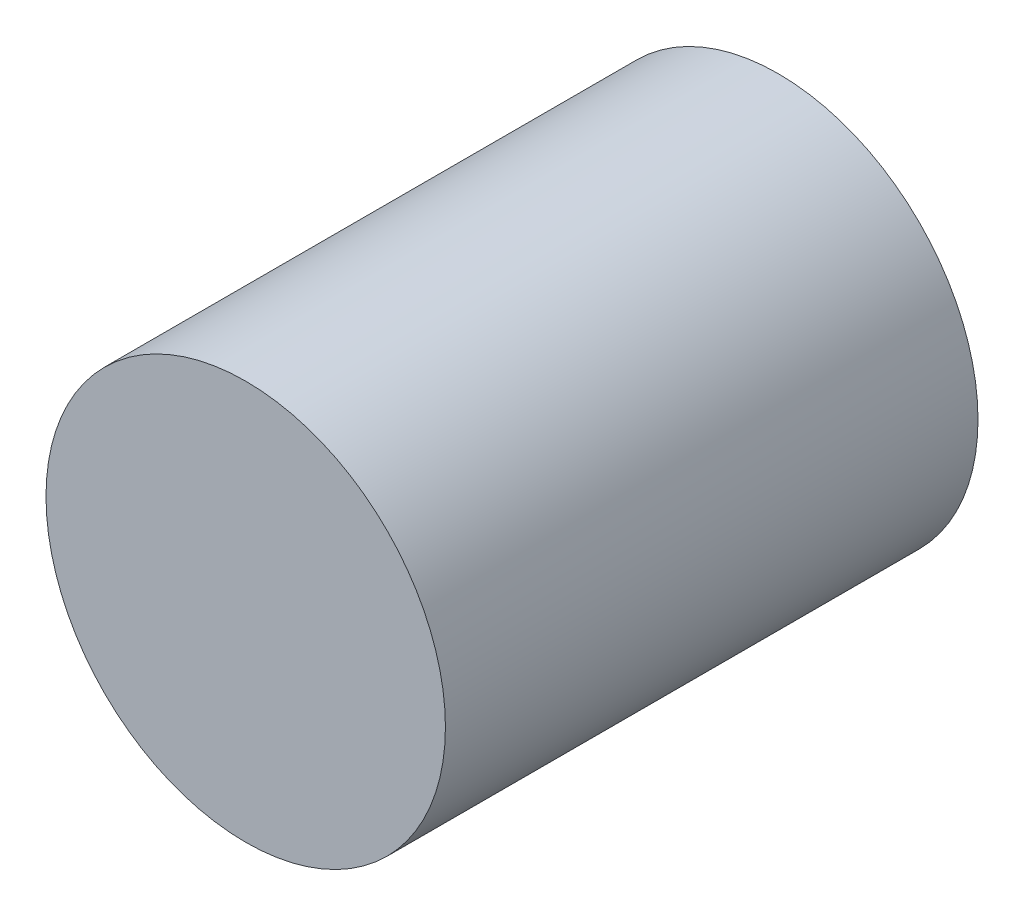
from build123d import *

# Parameters (mm, degrees)
ESQUISSE1_R      = 1.125
EXTRUSION1_DEPTH = 3


with BuildPart() as part:
    # Esquisse1 → Extrusion1 (new body)
    with BuildSketch(Plane.XY):
        Circle(ESQUISSE1_R)
    extrude(amount=EXTRUSION1_DEPTH)


solid = part.part
